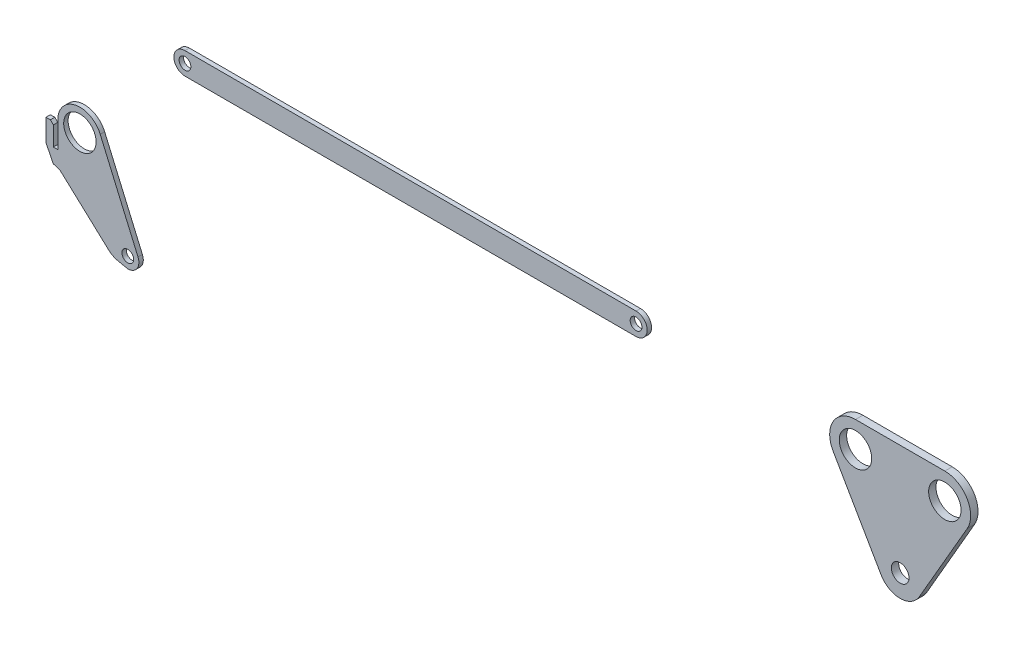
ISO-10303-21;
HEADER;
FILE_DESCRIPTION(('STEP AP214'),'2;1');
FILE_NAME('part.step','',(''),(''),'','','');
FILE_SCHEMA(('AUTOMOTIVE_DESIGN { 1 0 10303 214 1 1 1 1 }'));
ENDSEC;
DATA;
#1=APPLICATION_CONTEXT('core data for automotive mechanical design processes');
#2=APPLICATION_PROTOCOL_DEFINITION('international standard','automotive_design',2000,#1);
#3=PRODUCT_CONTEXT('',#1,'mechanical');
#4=PRODUCT('Part','Part','',(#3));
#5=PRODUCT_RELATED_PRODUCT_CATEGORY('part','',(#4));
#6=PRODUCT_DEFINITION_FORMATION('','',#4);
#7=PRODUCT_DEFINITION_CONTEXT('part definition',#1,'design');
#8=PRODUCT_DEFINITION('design','',#6,#7);
#9=PRODUCT_DEFINITION_SHAPE('','',#8);
#10=(LENGTH_UNIT() NAMED_UNIT(*) SI_UNIT(.MILLI.,.METRE.));
#11=(NAMED_UNIT(*) PLANE_ANGLE_UNIT() SI_UNIT($,.RADIAN.));
#12=(NAMED_UNIT(*) SI_UNIT($,.STERADIAN.) SOLID_ANGLE_UNIT());
#13=UNCERTAINTY_MEASURE_WITH_UNIT(LENGTH_MEASURE(1.E-05),#10,'distance_accuracy_value','');
#14=(GEOMETRIC_REPRESENTATION_CONTEXT(3) GLOBAL_UNCERTAINTY_ASSIGNED_CONTEXT((#13)) GLOBAL_UNIT_ASSIGNED_CONTEXT((#10,
#11,#12)) REPRESENTATION_CONTEXT('',''));
#15=CARTESIAN_POINT('',(0.,0.,0.));
#16=DIRECTION('',(0.,0.,1.));
#17=DIRECTION('',(1.,0.,0.));
#18=AXIS2_PLACEMENT_3D('',#15,#16,#17);
#19=CARTESIAN_POINT('',(-475.912806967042,-67.8616147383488,53.));
#20=DIRECTION('',(0.,0.,1.));
#21=DIRECTION('',(1.,0.,0.));
#22=AXIS2_PLACEMENT_3D('',#19,#20,#21);
#23=PLANE('',#22);
#24=CARTESIAN_POINT('',(-508.412806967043,-11.5699634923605,53.));
#25=DIRECTION('',(0.,0.,1.));
#26=DIRECTION('',(1.,0.,0.));
#27=AXIS2_PLACEMENT_3D('',#24,#25,#26);
#28=CIRCLE('',#27,11.0000000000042);
#29=CARTESIAN_POINT('',(-497.412806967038,-11.5699634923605,53.));
#30=VERTEX_POINT('',#29);
#31=EDGE_CURVE('E187',#30,#30,#28,.T.);
#32=ORIENTED_EDGE('',*,*,#31,.F.);
#33=EDGE_LOOP('',(#32));
#34=FACE_BOUND('',#33,.T.);
#35=DIRECTION('',(-1.,0.,0.));
#36=VECTOR('',#35,1.);
#37=CARTESIAN_POINT('',(-523.412806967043,-29.0150571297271,53.));
#38=LINE('',#37,#36);
#39=CARTESIAN_POINT('',(-523.412806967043,-29.0150571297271,53.));
#40=VERTEX_POINT('',#39);
#41=CARTESIAN_POINT('',(-526.412806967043,-29.0150571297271,53.));
#42=VERTEX_POINT('',#41);
#43=EDGE_CURVE('E212',#40,#42,#38,.T.);
#44=ORIENTED_EDGE('',*,*,#43,.T.);
#45=DIRECTION('',(0.,1.,0.));
#46=VECTOR('',#45,1.);
#47=CARTESIAN_POINT('',(-526.412806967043,-29.0150571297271,53.));
#48=LINE('',#47,#46);
#49=CARTESIAN_POINT('',(-526.412806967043,-16.0150571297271,53.));
#50=VERTEX_POINT('',#49);
#51=EDGE_CURVE('E125',#42,#50,#48,.T.);
#52=ORIENTED_EDGE('',*,*,#51,.T.);
#53=DIRECTION('',(-0.707106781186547,0.707106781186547,0.));
#54=VECTOR('',#53,1.);
#55=CARTESIAN_POINT('',(-526.412806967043,-16.0150571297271,53.));
#56=LINE('',#55,#54);
#57=CARTESIAN_POINT('',(-528.412806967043,-14.0150571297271,53.));
#58=VERTEX_POINT('',#57);
#59=EDGE_CURVE('E248',#50,#58,#56,.T.);
#60=ORIENTED_EDGE('',*,*,#59,.T.);
#61=DIRECTION('',(-1.,0.,0.));
#62=VECTOR('',#61,1.);
#63=CARTESIAN_POINT('',(-528.412806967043,-14.0150571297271,53.));
#64=LINE('',#63,#62);
#65=CARTESIAN_POINT('',(-531.412806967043,-14.0150571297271,53.));
#66=VERTEX_POINT('',#65);
#67=EDGE_CURVE('E267',#58,#66,#64,.T.);
#68=ORIENTED_EDGE('',*,*,#67,.T.);
#69=DIRECTION('',(0.,-1.,0.));
#70=VECTOR('',#69,1.);
#71=CARTESIAN_POINT('',(-531.412806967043,-14.0150571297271,53.));
#72=LINE('',#71,#70);
#73=CARTESIAN_POINT('',(-531.412806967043,-29.0150571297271,53.));
#74=VERTEX_POINT('',#73);
#75=EDGE_CURVE('E264',#66,#74,#72,.T.);
#76=ORIENTED_EDGE('',*,*,#75,.T.);
#77=DIRECTION('',(0.447213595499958,-0.894427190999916,0.));
#78=VECTOR('',#77,1.);
#79=CARTESIAN_POINT('',(-531.412806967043,-29.0150571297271,53.));
#80=LINE('',#79,#78);
#81=CARTESIAN_POINT('',(-526.412806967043,-39.0150571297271,53.));
#82=VERTEX_POINT('',#81);
#83=EDGE_CURVE('E266',#74,#82,#80,.T.);
#84=ORIENTED_EDGE('',*,*,#83,.T.);
#85=DIRECTION('',(1.,0.,0.));
#86=VECTOR('',#85,1.);
#87=CARTESIAN_POINT('',(-526.412806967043,-39.0150571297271,53.));
#88=LINE('',#87,#86);
#89=CARTESIAN_POINT('',(-525.412806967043,-39.0150571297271,53.));
#90=VERTEX_POINT('',#89);
#91=EDGE_CURVE('E269',#82,#90,#88,.T.);
#92=ORIENTED_EDGE('',*,*,#91,.T.);
#93=DIRECTION('',(0.931756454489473,-0.363083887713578,0.));
#94=VECTOR('',#93,1.);
#95=CARTESIAN_POINT('',(-525.412806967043,-39.0150571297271,53.));
#96=LINE('',#95,#94);
#97=CARTESIAN_POINT('',(-521.940126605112,-40.3682801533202,53.));
#98=VERTEX_POINT('',#97);
#99=EDGE_CURVE('E275',#90,#98,#96,.T.);
#100=ORIENTED_EDGE('',*,*,#99,.T.);
#101=DIRECTION('',(0.736340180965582,-0.676611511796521,0.));
#102=VECTOR('',#101,1.);
#103=CARTESIAN_POINT('',(-521.940126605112,-40.3682801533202,53.));
#104=LINE('',#103,#102);
#105=CARTESIAN_POINT('',(-487.691647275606,-71.8386738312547,53.));
#106=VERTEX_POINT('',#105);
#107=EDGE_CURVE('E277',#98,#106,#104,.T.);
#108=ORIENTED_EDGE('',*,*,#107,.T.);
#109=DIRECTION('',(0.889144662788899,-0.45762623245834,0.));
#110=VECTOR('',#109,1.);
#111=CARTESIAN_POINT('',(-487.691647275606,-71.8386738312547,53.));
#112=LINE('',#111,#110);
#113=CARTESIAN_POINT('',(-484.261867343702,-73.6039178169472,53.));
#114=VERTEX_POINT('',#113);
#115=EDGE_CURVE('E279',#106,#114,#112,.T.);
#116=ORIENTED_EDGE('',*,*,#115,.T.);
#117=DIRECTION('',(0.978549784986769,-0.206010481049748,0.));
#118=VECTOR('',#117,1.);
#119=CARTESIAN_POINT('',(-484.261867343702,-73.6039178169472,53.));
#120=LINE('',#119,#118);
#121=CARTESIAN_POINT('',(-475.91280696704,-75.3616147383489,53.));
#122=VERTEX_POINT('',#121);
#123=EDGE_CURVE('E281',#114,#122,#120,.T.);
#124=ORIENTED_EDGE('',*,*,#123,.T.);
#125=CARTESIAN_POINT('',(-475.912806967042,-67.8616147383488,53.));
#126=DIRECTION('',(0.,0.,1.));
#127=DIRECTION('',(1.,0.,0.));
#128=AXIS2_PLACEMENT_3D('',#125,#126,#127);
#129=CIRCLE('',#128,7.50000000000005);
#130=CARTESIAN_POINT('',(-469.028306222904,-64.8861064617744,53.));
#131=VERTEX_POINT('',#130);
#132=EDGE_CURVE('E165',#122,#131,#129,.T.);
#133=ORIENTED_EDGE('',*,*,#132,.T.);
#134=DIRECTION('',(-0.396734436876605,0.917933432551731,0.));
#135=VECTOR('',#134,1.);
#136=CARTESIAN_POINT('',(-494.643805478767,-5.61894693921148,53.));
#137=LINE('',#136,#135);
#138=CARTESIAN_POINT('',(-494.643805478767,-5.61894693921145,53.));
#139=VERTEX_POINT('',#138);
#140=EDGE_CURVE('E159',#131,#139,#137,.T.);
#141=ORIENTED_EDGE('',*,*,#140,.T.);
#142=CARTESIAN_POINT('',(-508.412806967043,-11.5699634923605,53.));
#143=DIRECTION('',(0.,0.,1.));
#144=DIRECTION('',(1.,0.,0.));
#145=AXIS2_PLACEMENT_3D('',#142,#143,#144);
#146=CIRCLE('',#145,15.0000000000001);
#147=CARTESIAN_POINT('',(-523.412806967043,-11.5699634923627,53.));
#148=VERTEX_POINT('',#147);
#149=EDGE_CURVE('E163',#139,#148,#146,.T.);
#150=ORIENTED_EDGE('',*,*,#149,.T.);
#151=DIRECTION('',(0.,-1.,0.));
#152=VECTOR('',#151,1.);
#153=CARTESIAN_POINT('',(-523.412806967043,-11.5699634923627,53.));
#154=LINE('',#153,#152);
#155=EDGE_CURVE('E61',#148,#40,#154,.T.);
#156=ORIENTED_EDGE('',*,*,#155,.T.);
#157=EDGE_LOOP('',(#44,#52,#60,#68,#76,#84,#92,#100,#108,#116,#124,#133,#141,#150,#156));
#158=FACE_BOUND('',#157,.T.);
#159=CARTESIAN_POINT('',(-475.912806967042,-67.8616147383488,53.));
#160=DIRECTION('',(0.,0.,1.));
#161=DIRECTION('',(1.,0.,0.));
#162=AXIS2_PLACEMENT_3D('',#159,#160,#161);
#163=CIRCLE('',#162,4.0000000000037);
#164=CARTESIAN_POINT('',(-471.912806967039,-67.8616147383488,53.));
#165=VERTEX_POINT('',#164);
#166=EDGE_CURVE('E323',#165,#165,#163,.T.);
#167=ORIENTED_EDGE('',*,*,#166,.F.);
#168=EDGE_LOOP('',(#167));
#169=FACE_BOUND('',#168,.T.);
#170=ADVANCED_FACE('F44',(#34,#158,#169),#23,.T.);
#171=CARTESIAN_POINT('',(-475.912806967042,-67.8616147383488,50.));
#172=DIRECTION('',(0.,0.,1.));
#173=DIRECTION('',(1.,0.,0.));
#174=AXIS2_PLACEMENT_3D('',#171,#172,#173);
#175=PLANE('',#174);
#176=DIRECTION('',(-1.,0.,0.));
#177=VECTOR('',#176,1.);
#178=CARTESIAN_POINT('',(-523.412806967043,-29.0150571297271,50.));
#179=LINE('',#178,#177);
#180=CARTESIAN_POINT('',(-523.412806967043,-29.0150571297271,50.));
#181=VERTEX_POINT('',#180);
#182=CARTESIAN_POINT('',(-526.412806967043,-29.0150571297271,50.));
#183=VERTEX_POINT('',#182);
#184=EDGE_CURVE('E183',#181,#183,#179,.T.);
#185=ORIENTED_EDGE('',*,*,#184,.F.);
#186=DIRECTION('',(0.,-1.,0.));
#187=VECTOR('',#186,1.);
#188=CARTESIAN_POINT('',(-523.412806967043,-11.5699634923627,50.));
#189=LINE('',#188,#187);
#190=CARTESIAN_POINT('',(-523.412806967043,-11.5699634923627,50.));
#191=VERTEX_POINT('',#190);
#192=EDGE_CURVE('E117',#191,#181,#189,.T.);
#193=ORIENTED_EDGE('',*,*,#192,.F.);
#194=CARTESIAN_POINT('',(-508.412806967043,-11.5699634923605,50.));
#195=DIRECTION('',(0.,0.,1.));
#196=DIRECTION('',(1.,0.,0.));
#197=AXIS2_PLACEMENT_3D('',#194,#195,#196);
#198=CIRCLE('',#197,15.0000000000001);
#199=CARTESIAN_POINT('',(-494.643805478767,-5.61894693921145,50.));
#200=VERTEX_POINT('',#199);
#201=EDGE_CURVE('E111',#200,#191,#198,.T.);
#202=ORIENTED_EDGE('',*,*,#201,.F.);
#203=DIRECTION('',(-0.396734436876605,0.917933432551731,0.));
#204=VECTOR('',#203,1.);
#205=CARTESIAN_POINT('',(-494.643805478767,-5.61894693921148,50.));
#206=LINE('',#205,#204);
#207=CARTESIAN_POINT('',(-469.028306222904,-64.8861064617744,50.));
#208=VERTEX_POINT('',#207);
#209=EDGE_CURVE('E173',#208,#200,#206,.T.);
#210=ORIENTED_EDGE('',*,*,#209,.F.);
#211=CARTESIAN_POINT('',(-475.912806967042,-67.8616147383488,50.));
#212=DIRECTION('',(0.,0.,1.));
#213=DIRECTION('',(1.,0.,0.));
#214=AXIS2_PLACEMENT_3D('',#211,#212,#213);
#215=CIRCLE('',#214,7.50000000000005);
#216=CARTESIAN_POINT('',(-475.91280696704,-75.3616147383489,50.));
#217=VERTEX_POINT('',#216);
#218=EDGE_CURVE('E207',#217,#208,#215,.T.);
#219=ORIENTED_EDGE('',*,*,#218,.F.);
#220=DIRECTION('',(0.978549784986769,-0.206010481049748,0.));
#221=VECTOR('',#220,1.);
#222=CARTESIAN_POINT('',(-484.261867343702,-73.6039178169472,50.));
#223=LINE('',#222,#221);
#224=CARTESIAN_POINT('',(-484.261867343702,-73.6039178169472,50.));
#225=VERTEX_POINT('',#224);
#226=EDGE_CURVE('E205',#225,#217,#223,.T.);
#227=ORIENTED_EDGE('',*,*,#226,.F.);
#228=DIRECTION('',(0.889144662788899,-0.45762623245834,0.));
#229=VECTOR('',#228,1.);
#230=CARTESIAN_POINT('',(-487.691647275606,-71.8386738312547,50.));
#231=LINE('',#230,#229);
#232=CARTESIAN_POINT('',(-487.691647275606,-71.8386738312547,50.));
#233=VERTEX_POINT('',#232);
#234=EDGE_CURVE('E203',#233,#225,#231,.T.);
#235=ORIENTED_EDGE('',*,*,#234,.F.);
#236=DIRECTION('',(0.736340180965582,-0.676611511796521,0.));
#237=VECTOR('',#236,1.);
#238=CARTESIAN_POINT('',(-521.940126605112,-40.3682801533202,50.));
#239=LINE('',#238,#237);
#240=CARTESIAN_POINT('',(-521.940126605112,-40.3682801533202,50.));
#241=VERTEX_POINT('',#240);
#242=EDGE_CURVE('E201',#241,#233,#239,.T.);
#243=ORIENTED_EDGE('',*,*,#242,.F.);
#244=DIRECTION('',(0.931756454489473,-0.363083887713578,0.));
#245=VECTOR('',#244,1.);
#246=CARTESIAN_POINT('',(-525.412806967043,-39.0150571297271,50.));
#247=LINE('',#246,#245);
#248=CARTESIAN_POINT('',(-525.412806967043,-39.0150571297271,50.));
#249=VERTEX_POINT('',#248);
#250=EDGE_CURVE('E199',#249,#241,#247,.T.);
#251=ORIENTED_EDGE('',*,*,#250,.F.);
#252=DIRECTION('',(1.,0.,0.));
#253=VECTOR('',#252,1.);
#254=CARTESIAN_POINT('',(-526.412806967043,-39.0150571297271,50.));
#255=LINE('',#254,#253);
#256=CARTESIAN_POINT('',(-526.412806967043,-39.0150571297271,50.));
#257=VERTEX_POINT('',#256);
#258=EDGE_CURVE('E197',#257,#249,#255,.T.);
#259=ORIENTED_EDGE('',*,*,#258,.F.);
#260=DIRECTION('',(0.447213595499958,-0.894427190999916,0.));
#261=VECTOR('',#260,1.);
#262=CARTESIAN_POINT('',(-531.412806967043,-29.0150571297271,50.));
#263=LINE('',#262,#261);
#264=CARTESIAN_POINT('',(-531.412806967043,-29.0150571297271,50.));
#265=VERTEX_POINT('',#264);
#266=EDGE_CURVE('E195',#265,#257,#263,.T.);
#267=ORIENTED_EDGE('',*,*,#266,.F.);
#268=DIRECTION('',(0.,-1.,0.));
#269=VECTOR('',#268,1.);
#270=CARTESIAN_POINT('',(-531.412806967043,-14.0150571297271,50.));
#271=LINE('',#270,#269);
#272=CARTESIAN_POINT('',(-531.412806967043,-14.0150571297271,50.));
#273=VERTEX_POINT('',#272);
#274=EDGE_CURVE('E193',#273,#265,#271,.T.);
#275=ORIENTED_EDGE('',*,*,#274,.F.);
#276=DIRECTION('',(-1.,0.,0.));
#277=VECTOR('',#276,1.);
#278=CARTESIAN_POINT('',(-528.412806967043,-14.0150571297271,50.));
#279=LINE('',#278,#277);
#280=CARTESIAN_POINT('',(-528.412806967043,-14.0150571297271,50.));
#281=VERTEX_POINT('',#280);
#282=EDGE_CURVE('E191',#281,#273,#279,.T.);
#283=ORIENTED_EDGE('',*,*,#282,.F.);
#284=DIRECTION('',(-0.707106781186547,0.707106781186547,0.));
#285=VECTOR('',#284,1.);
#286=CARTESIAN_POINT('',(-526.412806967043,-16.0150571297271,50.));
#287=LINE('',#286,#285);
#288=CARTESIAN_POINT('',(-526.412806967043,-16.0150571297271,50.));
#289=VERTEX_POINT('',#288);
#290=EDGE_CURVE('E189',#289,#281,#287,.T.);
#291=ORIENTED_EDGE('',*,*,#290,.F.);
#292=DIRECTION('',(0.,1.,0.));
#293=VECTOR('',#292,1.);
#294=CARTESIAN_POINT('',(-526.412806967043,-29.0150571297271,50.));
#295=LINE('',#294,#293);
#296=EDGE_CURVE('E186',#183,#289,#295,.T.);
#297=ORIENTED_EDGE('',*,*,#296,.F.);
#298=EDGE_LOOP('',(#185,#193,#202,#210,#219,#227,#235,#243,#251,#259,#267,#275,#283,#291,#297));
#299=FACE_BOUND('',#298,.T.);
#300=CARTESIAN_POINT('',(-508.412806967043,-11.5699634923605,50.));
#301=DIRECTION('',(0.,0.,1.));
#302=DIRECTION('',(1.,0.,0.));
#303=AXIS2_PLACEMENT_3D('',#300,#301,#302);
#304=CIRCLE('',#303,11.0000000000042);
#305=CARTESIAN_POINT('',(-497.412806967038,-11.5699634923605,50.));
#306=VERTEX_POINT('',#305);
#307=EDGE_CURVE('E329',#306,#306,#304,.T.);
#308=ORIENTED_EDGE('',*,*,#307,.T.);
#309=EDGE_LOOP('',(#308));
#310=FACE_BOUND('',#309,.T.);
#311=CARTESIAN_POINT('',(-475.912806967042,-67.8616147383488,50.));
#312=DIRECTION('',(0.,0.,1.));
#313=DIRECTION('',(1.,0.,0.));
#314=AXIS2_PLACEMENT_3D('',#311,#312,#313);
#315=CIRCLE('',#314,4.0000000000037);
#316=CARTESIAN_POINT('',(-471.912806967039,-67.8616147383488,50.));
#317=VERTEX_POINT('',#316);
#318=EDGE_CURVE('E326',#317,#317,#315,.T.);
#319=ORIENTED_EDGE('',*,*,#318,.T.);
#320=EDGE_LOOP('',(#319));
#321=FACE_BOUND('',#320,.T.);
#322=ADVANCED_FACE('F252',(#299,#310,#321),#175,.F.);
#323=CARTESIAN_POINT('',(-523.412806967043,-29.0150571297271,53.));
#324=DIRECTION('',(0.,-1.,0.));
#325=DIRECTION('',(0.,0.,-1.));
#326=AXIS2_PLACEMENT_3D('',#323,#324,#325);
#327=PLANE('',#326);
#328=ORIENTED_EDGE('',*,*,#184,.T.);
#329=DIRECTION('',(0.,0.,-1.));
#330=VECTOR('',#329,1.);
#331=CARTESIAN_POINT('',(-526.412806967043,-29.0150571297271,53.));
#332=LINE('',#331,#330);
#333=EDGE_CURVE('E12',#42,#183,#332,.T.);
#334=ORIENTED_EDGE('',*,*,#333,.F.);
#335=ORIENTED_EDGE('',*,*,#43,.F.);
#336=DIRECTION('',(0.,0.,-1.));
#337=VECTOR('',#336,1.);
#338=CARTESIAN_POINT('',(-523.412806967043,-29.0150571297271,53.));
#339=LINE('',#338,#337);
#340=EDGE_CURVE('E179',#40,#181,#339,.T.);
#341=ORIENTED_EDGE('',*,*,#340,.T.);
#342=EDGE_LOOP('',(#328,#334,#335,#341));
#343=FACE_BOUND('',#342,.T.);
#344=ADVANCED_FACE('F46',(#343),#327,.F.);
#345=CARTESIAN_POINT('',(-526.412806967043,-29.0150571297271,53.));
#346=DIRECTION('',(-1.,0.,0.));
#347=DIRECTION('',(0.,0.,1.));
#348=AXIS2_PLACEMENT_3D('',#345,#346,#347);
#349=PLANE('',#348);
#350=ORIENTED_EDGE('',*,*,#296,.T.);
#351=DIRECTION('',(0.,0.,-1.));
#352=VECTOR('',#351,1.);
#353=CARTESIAN_POINT('',(-526.412806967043,-16.0150571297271,53.));
#354=LINE('',#353,#352);
#355=EDGE_CURVE('E53',#50,#289,#354,.T.);
#356=ORIENTED_EDGE('',*,*,#355,.F.);
#357=ORIENTED_EDGE('',*,*,#51,.F.);
#358=ORIENTED_EDGE('',*,*,#333,.T.);
#359=EDGE_LOOP('',(#350,#356,#357,#358));
#360=FACE_BOUND('',#359,.T.);
#361=ADVANCED_FACE('F452',(#360),#349,.F.);
#362=CARTESIAN_POINT('',(-526.412806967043,-16.0150571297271,53.));
#363=DIRECTION('',(-0.707106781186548,-0.707106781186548,0.));
#364=DIRECTION('',(0.707106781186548,-0.707106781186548,0.));
#365=AXIS2_PLACEMENT_3D('',#362,#363,#364);
#366=PLANE('',#365);
#367=ORIENTED_EDGE('',*,*,#290,.T.);
#368=DIRECTION('',(0.,0.,-1.));
#369=VECTOR('',#368,1.);
#370=CARTESIAN_POINT('',(-528.412806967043,-14.0150571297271,53.));
#371=LINE('',#370,#369);
#372=EDGE_CURVE('E240',#58,#281,#371,.T.);
#373=ORIENTED_EDGE('',*,*,#372,.F.);
#374=ORIENTED_EDGE('',*,*,#59,.F.);
#375=ORIENTED_EDGE('',*,*,#355,.T.);
#376=EDGE_LOOP('',(#367,#373,#374,#375));
#377=FACE_BOUND('',#376,.T.);
#378=ADVANCED_FACE('F246',(#377),#366,.F.);
#379=CARTESIAN_POINT('',(-528.412806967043,-14.0150571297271,53.));
#380=DIRECTION('',(0.,-1.,0.));
#381=DIRECTION('',(0.,0.,-1.));
#382=AXIS2_PLACEMENT_3D('',#379,#380,#381);
#383=PLANE('',#382);
#384=ORIENTED_EDGE('',*,*,#282,.T.);
#385=DIRECTION('',(0.,0.,-1.));
#386=VECTOR('',#385,1.);
#387=CARTESIAN_POINT('',(-531.412806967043,-14.0150571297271,53.));
#388=LINE('',#387,#386);
#389=EDGE_CURVE('E237',#66,#273,#388,.T.);
#390=ORIENTED_EDGE('',*,*,#389,.F.);
#391=ORIENTED_EDGE('',*,*,#67,.F.);
#392=ORIENTED_EDGE('',*,*,#372,.T.);
#393=EDGE_LOOP('',(#384,#390,#391,#392));
#394=FACE_BOUND('',#393,.T.);
#395=ADVANCED_FACE('F258',(#394),#383,.F.);
#396=CARTESIAN_POINT('',(-531.412806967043,-14.0150571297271,53.));
#397=DIRECTION('',(1.,0.,0.));
#398=DIRECTION('',(0.,0.,-1.));
#399=AXIS2_PLACEMENT_3D('',#396,#397,#398);
#400=PLANE('',#399);
#401=ORIENTED_EDGE('',*,*,#274,.T.);
#402=DIRECTION('',(0.,0.,-1.));
#403=VECTOR('',#402,1.);
#404=CARTESIAN_POINT('',(-531.412806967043,-29.0150571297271,53.));
#405=LINE('',#404,#403);
#406=EDGE_CURVE('E234',#74,#265,#405,.T.);
#407=ORIENTED_EDGE('',*,*,#406,.F.);
#408=ORIENTED_EDGE('',*,*,#75,.F.);
#409=ORIENTED_EDGE('',*,*,#389,.T.);
#410=EDGE_LOOP('',(#401,#407,#408,#409));
#411=FACE_BOUND('',#410,.T.);
#412=ADVANCED_FACE('F262',(#411),#400,.F.);
#413=CARTESIAN_POINT('',(-531.412806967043,-29.0150571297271,53.));
#414=DIRECTION('',(0.894427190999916,0.447213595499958,0.));
#415=DIRECTION('',(-0.447213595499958,0.894427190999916,0.));
#416=AXIS2_PLACEMENT_3D('',#413,#414,#415);
#417=PLANE('',#416);
#418=ORIENTED_EDGE('',*,*,#266,.T.);
#419=DIRECTION('',(0.,0.,-1.));
#420=VECTOR('',#419,1.);
#421=CARTESIAN_POINT('',(-526.412806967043,-39.0150571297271,53.));
#422=LINE('',#421,#420);
#423=EDGE_CURVE('E231',#82,#257,#422,.T.);
#424=ORIENTED_EDGE('',*,*,#423,.F.);
#425=ORIENTED_EDGE('',*,*,#83,.F.);
#426=ORIENTED_EDGE('',*,*,#406,.T.);
#427=EDGE_LOOP('',(#418,#424,#425,#426));
#428=FACE_BOUND('',#427,.T.);
#429=ADVANCED_FACE('F417',(#428),#417,.F.);
#430=CARTESIAN_POINT('',(-526.412806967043,-39.0150571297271,53.));
#431=DIRECTION('',(0.,1.,0.));
#432=DIRECTION('',(0.,0.,1.));
#433=AXIS2_PLACEMENT_3D('',#430,#431,#432);
#434=PLANE('',#433);
#435=ORIENTED_EDGE('',*,*,#258,.T.);
#436=DIRECTION('',(0.,0.,-1.));
#437=VECTOR('',#436,1.);
#438=CARTESIAN_POINT('',(-525.412806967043,-39.0150571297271,53.));
#439=LINE('',#438,#437);
#440=EDGE_CURVE('E228',#90,#249,#439,.T.);
#441=ORIENTED_EDGE('',*,*,#440,.F.);
#442=ORIENTED_EDGE('',*,*,#91,.F.);
#443=ORIENTED_EDGE('',*,*,#423,.T.);
#444=EDGE_LOOP('',(#435,#441,#442,#443));
#445=FACE_BOUND('',#444,.T.);
#446=ADVANCED_FACE('F407',(#445),#434,.F.);
#447=CARTESIAN_POINT('',(-525.412806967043,-39.0150571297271,53.));
#448=DIRECTION('',(0.363083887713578,0.931756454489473,0.));
#449=DIRECTION('',(-0.931756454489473,0.363083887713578,0.));
#450=AXIS2_PLACEMENT_3D('',#447,#448,#449);
#451=PLANE('',#450);
#452=ORIENTED_EDGE('',*,*,#250,.T.);
#453=DIRECTION('',(0.,0.,-1.));
#454=VECTOR('',#453,1.);
#455=CARTESIAN_POINT('',(-521.940126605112,-40.3682801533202,53.));
#456=LINE('',#455,#454);
#457=EDGE_CURVE('E225',#98,#241,#456,.T.);
#458=ORIENTED_EDGE('',*,*,#457,.F.);
#459=ORIENTED_EDGE('',*,*,#99,.F.);
#460=ORIENTED_EDGE('',*,*,#440,.T.);
#461=EDGE_LOOP('',(#452,#458,#459,#460));
#462=FACE_BOUND('',#461,.T.);
#463=ADVANCED_FACE('F397',(#462),#451,.F.);
#464=CARTESIAN_POINT('',(-521.940126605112,-40.3682801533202,53.));
#465=DIRECTION('',(0.676611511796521,0.736340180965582,0.));
#466=DIRECTION('',(-0.736340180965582,0.676611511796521,0.));
#467=AXIS2_PLACEMENT_3D('',#464,#465,#466);
#468=PLANE('',#467);
#469=ORIENTED_EDGE('',*,*,#242,.T.);
#470=DIRECTION('',(0.,0.,-1.));
#471=VECTOR('',#470,1.);
#472=CARTESIAN_POINT('',(-487.691647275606,-71.8386738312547,53.));
#473=LINE('',#472,#471);
#474=EDGE_CURVE('E222',#106,#233,#473,.T.);
#475=ORIENTED_EDGE('',*,*,#474,.F.);
#476=ORIENTED_EDGE('',*,*,#107,.F.);
#477=ORIENTED_EDGE('',*,*,#457,.T.);
#478=EDGE_LOOP('',(#469,#475,#476,#477));
#479=FACE_BOUND('',#478,.T.);
#480=ADVANCED_FACE('F387',(#479),#468,.F.);
#481=CARTESIAN_POINT('',(-487.691647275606,-71.8386738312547,53.));
#482=DIRECTION('',(0.45762623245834,0.889144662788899,0.));
#483=DIRECTION('',(-0.889144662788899,0.45762623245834,0.));
#484=AXIS2_PLACEMENT_3D('',#481,#482,#483);
#485=PLANE('',#484);
#486=ORIENTED_EDGE('',*,*,#234,.T.);
#487=DIRECTION('',(0.,0.,-1.));
#488=VECTOR('',#487,1.);
#489=CARTESIAN_POINT('',(-484.261867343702,-73.6039178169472,53.));
#490=LINE('',#489,#488);
#491=EDGE_CURVE('E219',#114,#225,#490,.T.);
#492=ORIENTED_EDGE('',*,*,#491,.F.);
#493=ORIENTED_EDGE('',*,*,#115,.F.);
#494=ORIENTED_EDGE('',*,*,#474,.T.);
#495=EDGE_LOOP('',(#486,#492,#493,#494));
#496=FACE_BOUND('',#495,.T.);
#497=ADVANCED_FACE('F378',(#496),#485,.F.);
#498=CARTESIAN_POINT('',(-484.261867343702,-73.6039178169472,53.));
#499=DIRECTION('',(0.206010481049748,0.978549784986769,0.));
#500=DIRECTION('',(-0.978549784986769,0.206010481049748,0.));
#501=AXIS2_PLACEMENT_3D('',#498,#499,#500);
#502=PLANE('',#501);
#503=ORIENTED_EDGE('',*,*,#226,.T.);
#504=DIRECTION('',(0.,0.,-1.));
#505=VECTOR('',#504,1.);
#506=CARTESIAN_POINT('',(-475.91280696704,-75.3616147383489,53.));
#507=LINE('',#506,#505);
#508=EDGE_CURVE('E216',#122,#217,#507,.T.);
#509=ORIENTED_EDGE('',*,*,#508,.F.);
#510=ORIENTED_EDGE('',*,*,#123,.F.);
#511=ORIENTED_EDGE('',*,*,#491,.T.);
#512=EDGE_LOOP('',(#503,#509,#510,#511));
#513=FACE_BOUND('',#512,.T.);
#514=ADVANCED_FACE('F287',(#513),#502,.F.);
#515=CARTESIAN_POINT('',(-475.912806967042,-67.8616147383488,53.));
#516=DIRECTION('',(0.,0.,-1.));
#517=DIRECTION('',(-1.,0.,0.));
#518=AXIS2_PLACEMENT_3D('',#515,#516,#517);
#519=CYLINDRICAL_SURFACE('',#518,7.50000000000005);
#520=ORIENTED_EDGE('',*,*,#218,.T.);
#521=DIRECTION('',(0.,0.,-1.));
#522=VECTOR('',#521,1.);
#523=CARTESIAN_POINT('',(-469.028306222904,-64.8861064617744,53.));
#524=LINE('',#523,#522);
#525=EDGE_CURVE('E174',#131,#208,#524,.T.);
#526=ORIENTED_EDGE('',*,*,#525,.F.);
#527=ORIENTED_EDGE('',*,*,#132,.F.);
#528=ORIENTED_EDGE('',*,*,#508,.T.);
#529=EDGE_LOOP('',(#520,#526,#527,#528));
#530=FACE_BOUND('',#529,.T.);
#531=ADVANCED_FACE('F291',(#530),#519,.T.);
#532=CARTESIAN_POINT('',(-494.643805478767,-5.61894693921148,53.));
#533=DIRECTION('',(-0.917933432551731,-0.396734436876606,0.));
#534=DIRECTION('',(0.396734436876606,-0.917933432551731,0.));
#535=AXIS2_PLACEMENT_3D('',#532,#533,#534);
#536=PLANE('',#535);
#537=ORIENTED_EDGE('',*,*,#209,.T.);
#538=DIRECTION('',(0.,0.,-1.));
#539=VECTOR('',#538,1.);
#540=CARTESIAN_POINT('',(-494.643805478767,-5.61894693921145,53.));
#541=LINE('',#540,#539);
#542=EDGE_CURVE('E170',#139,#200,#541,.T.);
#543=ORIENTED_EDGE('',*,*,#542,.F.);
#544=ORIENTED_EDGE('',*,*,#140,.F.);
#545=ORIENTED_EDGE('',*,*,#525,.T.);
#546=EDGE_LOOP('',(#537,#543,#544,#545));
#547=FACE_BOUND('',#546,.T.);
#548=ADVANCED_FACE('F171',(#547),#536,.F.);
#549=CARTESIAN_POINT('',(-508.412806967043,-11.5699634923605,53.));
#550=DIRECTION('',(0.,0.,-1.));
#551=DIRECTION('',(-1.,0.,0.));
#552=AXIS2_PLACEMENT_3D('',#549,#550,#551);
#553=CYLINDRICAL_SURFACE('',#552,15.0000000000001);
#554=ORIENTED_EDGE('',*,*,#201,.T.);
#555=DIRECTION('',(0.,0.,-1.));
#556=VECTOR('',#555,1.);
#557=CARTESIAN_POINT('',(-523.412806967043,-11.5699634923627,53.));
#558=LINE('',#557,#556);
#559=EDGE_CURVE('E175',#148,#191,#558,.T.);
#560=ORIENTED_EDGE('',*,*,#559,.F.);
#561=ORIENTED_EDGE('',*,*,#149,.F.);
#562=ORIENTED_EDGE('',*,*,#542,.T.);
#563=EDGE_LOOP('',(#554,#560,#561,#562));
#564=FACE_BOUND('',#563,.T.);
#565=ADVANCED_FACE('F177',(#564),#553,.T.);
#566=CARTESIAN_POINT('',(-523.412806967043,-11.5699634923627,53.));
#567=DIRECTION('',(1.,0.,0.));
#568=DIRECTION('',(0.,0.,-1.));
#569=AXIS2_PLACEMENT_3D('',#566,#567,#568);
#570=PLANE('',#569);
#571=ORIENTED_EDGE('',*,*,#192,.T.);
#572=ORIENTED_EDGE('',*,*,#340,.F.);
#573=ORIENTED_EDGE('',*,*,#155,.F.);
#574=ORIENTED_EDGE('',*,*,#559,.T.);
#575=EDGE_LOOP('',(#571,#572,#573,#574));
#576=FACE_BOUND('',#575,.T.);
#577=ADVANCED_FACE('F295',(#576),#570,.F.);
#578=CARTESIAN_POINT('',(-508.412806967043,-11.5699634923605,53.));
#579=DIRECTION('',(0.,0.,-1.));
#580=DIRECTION('',(-1.,0.,0.));
#581=AXIS2_PLACEMENT_3D('',#578,#579,#580);
#582=CYLINDRICAL_SURFACE('',#581,11.0000000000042);
#583=ORIENTED_EDGE('',*,*,#31,.T.);
#584=EDGE_LOOP('',(#583));
#585=FACE_BOUND('',#584,.T.);
#586=ORIENTED_EDGE('',*,*,#307,.F.);
#587=EDGE_LOOP('',(#586));
#588=FACE_BOUND('',#587,.T.);
#589=ADVANCED_FACE('F297',(#585,#588),#582,.F.);
#590=CARTESIAN_POINT('',(-475.912806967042,-67.8616147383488,53.));
#591=DIRECTION('',(0.,0.,-1.));
#592=DIRECTION('',(-1.,0.,0.));
#593=AXIS2_PLACEMENT_3D('',#590,#591,#592);
#594=CYLINDRICAL_SURFACE('',#593,4.0000000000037);
#595=ORIENTED_EDGE('',*,*,#166,.T.);
#596=EDGE_LOOP('',(#595));
#597=FACE_BOUND('',#596,.T.);
#598=ORIENTED_EDGE('',*,*,#318,.F.);
#599=EDGE_LOOP('',(#598));
#600=FACE_BOUND('',#599,.T.);
#601=ADVANCED_FACE('F303',(#597,#600),#594,.F.);
#602=CLOSED_SHELL('',(#170,#322,#344,#361,#378,#395,#412,#429,#446,#463,#480,#497,#514,#531,
#548,#565,#577,#589,#601));
#603=MANIFOLD_SOLID_BREP('B2',#602);
#604=CARTESIAN_POINT('',(-156.140133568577,39.7740900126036,28.));
#605=DIRECTION('',(0.,0.,-1.));
#606=DIRECTION('',(-1.,0.,0.));
#607=AXIS2_PLACEMENT_3D('',#604,#605,#606);
#608=PLANE('',#607);
#609=CARTESIAN_POINT('',(-156.140133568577,39.7740900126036,28.));
#610=DIRECTION('',(0.,0.,1.));
#611=DIRECTION('',(-1.,0.,0.));
#612=AXIS2_PLACEMENT_3D('',#609,#610,#611);
#613=CIRCLE('',#612,7.49999999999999);
#614=CARTESIAN_POINT('',(-156.140133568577,32.2740900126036,28.));
#615=VERTEX_POINT('',#614);
#616=CARTESIAN_POINT('',(-156.140133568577,47.2740900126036,28.));
#617=VERTEX_POINT('',#616);
#618=EDGE_CURVE('E557',#615,#617,#613,.T.);
#619=ORIENTED_EDGE('',*,*,#618,.T.);
#620=DIRECTION('',(-1.,0.,0.));
#621=VECTOR('',#620,1.);
#622=CARTESIAN_POINT('',(-462.140133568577,47.2740900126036,28.));
#623=LINE('',#622,#621);
#624=CARTESIAN_POINT('',(-462.140133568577,47.2740900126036,28.));
#625=VERTEX_POINT('',#624);
#626=EDGE_CURVE('E552',#617,#625,#623,.T.);
#627=ORIENTED_EDGE('',*,*,#626,.T.);
#628=CARTESIAN_POINT('',(-462.140133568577,39.7740900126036,28.));
#629=DIRECTION('',(0.,0.,1.));
#630=DIRECTION('',(-1.,0.,0.));
#631=AXIS2_PLACEMENT_3D('',#628,#629,#630);
#632=CIRCLE('',#631,7.5);
#633=CARTESIAN_POINT('',(-462.140133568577,32.2740900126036,28.));
#634=VERTEX_POINT('',#633);
#635=EDGE_CURVE('E555',#625,#634,#632,.T.);
#636=ORIENTED_EDGE('',*,*,#635,.T.);
#637=DIRECTION('',(1.,0.,0.));
#638=VECTOR('',#637,1.);
#639=CARTESIAN_POINT('',(-462.140133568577,32.2740900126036,28.));
#640=LINE('',#639,#638);
#641=EDGE_CURVE('E522',#634,#615,#640,.T.);
#642=ORIENTED_EDGE('',*,*,#641,.T.);
#643=EDGE_LOOP('',(#619,#627,#636,#642));
#644=FACE_BOUND('',#643,.T.);
#645=CARTESIAN_POINT('',(-156.140133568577,39.7740900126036,28.));
#646=DIRECTION('',(0.,0.,1.));
#647=DIRECTION('',(1.,0.,0.));
#648=AXIS2_PLACEMENT_3D('',#645,#646,#647);
#649=CIRCLE('',#648,3.99999999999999);
#650=CARTESIAN_POINT('',(-152.140133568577,39.7740900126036,28.));
#651=VERTEX_POINT('',#650);
#652=EDGE_CURVE('E572',#651,#651,#649,.T.);
#653=ORIENTED_EDGE('',*,*,#652,.F.);
#654=EDGE_LOOP('',(#653));
#655=FACE_BOUND('',#654,.T.);
#656=CARTESIAN_POINT('',(-462.140133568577,39.7740900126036,28.));
#657=DIRECTION('',(0.,0.,1.));
#658=DIRECTION('',(1.,0.,0.));
#659=AXIS2_PLACEMENT_3D('',#656,#657,#658);
#660=CIRCLE('',#659,3.99999999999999);
#661=CARTESIAN_POINT('',(-458.140133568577,39.7740900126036,28.));
#662=VERTEX_POINT('',#661);
#663=EDGE_CURVE('E587',#662,#662,#660,.T.);
#664=ORIENTED_EDGE('',*,*,#663,.F.);
#665=EDGE_LOOP('',(#664));
#666=FACE_BOUND('',#665,.T.);
#667=ADVANCED_FACE('F505',(#644,#655,#666),#608,.F.);
#668=CARTESIAN_POINT('',(-156.140133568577,39.7740900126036,25.));
#669=DIRECTION('',(0.,0.,-1.));
#670=DIRECTION('',(-1.,0.,0.));
#671=AXIS2_PLACEMENT_3D('',#668,#669,#670);
#672=PLANE('',#671);
#673=CARTESIAN_POINT('',(-156.140133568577,39.7740900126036,25.));
#674=DIRECTION('',(0.,0.,1.));
#675=DIRECTION('',(1.,0.,0.));
#676=AXIS2_PLACEMENT_3D('',#673,#674,#675);
#677=CIRCLE('',#676,3.99999999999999);
#678=CARTESIAN_POINT('',(-152.140133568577,39.7740900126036,25.));
#679=VERTEX_POINT('',#678);
#680=EDGE_CURVE('E584',#679,#679,#677,.T.);
#681=ORIENTED_EDGE('',*,*,#680,.T.);
#682=EDGE_LOOP('',(#681));
#683=FACE_BOUND('',#682,.T.);
#684=CARTESIAN_POINT('',(-156.140133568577,39.7740900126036,25.));
#685=DIRECTION('',(0.,0.,1.));
#686=DIRECTION('',(-1.,0.,0.));
#687=AXIS2_PLACEMENT_3D('',#684,#685,#686);
#688=CIRCLE('',#687,7.49999999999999);
#689=CARTESIAN_POINT('',(-156.140133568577,32.2740900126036,25.));
#690=VERTEX_POINT('',#689);
#691=CARTESIAN_POINT('',(-156.140133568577,47.2740900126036,25.));
#692=VERTEX_POINT('',#691);
#693=EDGE_CURVE('E569',#690,#692,#688,.T.);
#694=ORIENTED_EDGE('',*,*,#693,.F.);
#695=DIRECTION('',(1.,0.,0.));
#696=VECTOR('',#695,1.);
#697=CARTESIAN_POINT('',(-462.140133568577,32.2740900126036,25.));
#698=LINE('',#697,#696);
#699=CARTESIAN_POINT('',(-462.140133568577,32.2740900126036,25.));
#700=VERTEX_POINT('',#699);
#701=EDGE_CURVE('E545',#700,#690,#698,.T.);
#702=ORIENTED_EDGE('',*,*,#701,.F.);
#703=CARTESIAN_POINT('',(-462.140133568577,39.7740900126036,25.));
#704=DIRECTION('',(0.,0.,1.));
#705=DIRECTION('',(-1.,0.,0.));
#706=AXIS2_PLACEMENT_3D('',#703,#704,#705);
#707=CIRCLE('',#706,7.5);
#708=CARTESIAN_POINT('',(-462.140133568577,47.2740900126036,25.));
#709=VERTEX_POINT('',#708);
#710=EDGE_CURVE('E539',#709,#700,#707,.T.);
#711=ORIENTED_EDGE('',*,*,#710,.F.);
#712=DIRECTION('',(-1.,0.,0.));
#713=VECTOR('',#712,1.);
#714=CARTESIAN_POINT('',(-462.140133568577,47.2740900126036,25.));
#715=LINE('',#714,#713);
#716=EDGE_CURVE('E561',#692,#709,#715,.T.);
#717=ORIENTED_EDGE('',*,*,#716,.F.);
#718=EDGE_LOOP('',(#694,#702,#711,#717));
#719=FACE_BOUND('',#718,.T.);
#720=CARTESIAN_POINT('',(-462.140133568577,39.7740900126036,25.));
#721=DIRECTION('',(0.,0.,1.));
#722=DIRECTION('',(1.,0.,0.));
#723=AXIS2_PLACEMENT_3D('',#720,#721,#722);
#724=CIRCLE('',#723,3.99999999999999);
#725=CARTESIAN_POINT('',(-458.140133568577,39.7740900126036,25.));
#726=VERTEX_POINT('',#725);
#727=EDGE_CURVE('E590',#726,#726,#724,.T.);
#728=ORIENTED_EDGE('',*,*,#727,.T.);
#729=EDGE_LOOP('',(#728));
#730=FACE_BOUND('',#729,.T.);
#731=ADVANCED_FACE('F580',(#683,#719,#730),#672,.T.);
#732=CARTESIAN_POINT('',(-156.140133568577,39.7740900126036,28.));
#733=DIRECTION('',(0.,0.,-1.));
#734=DIRECTION('',(-1.,0.,0.));
#735=AXIS2_PLACEMENT_3D('',#732,#733,#734);
#736=CYLINDRICAL_SURFACE('',#735,7.49999999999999);
#737=ORIENTED_EDGE('',*,*,#693,.T.);
#738=DIRECTION('',(0.,0.,-1.));
#739=VECTOR('',#738,1.);
#740=CARTESIAN_POINT('',(-156.140133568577,47.2740900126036,28.));
#741=LINE('',#740,#739);
#742=EDGE_CURVE('E42',#617,#692,#741,.T.);
#743=ORIENTED_EDGE('',*,*,#742,.F.);
#744=ORIENTED_EDGE('',*,*,#618,.F.);
#745=DIRECTION('',(0.,0.,-1.));
#746=VECTOR('',#745,1.);
#747=CARTESIAN_POINT('',(-156.140133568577,32.2740900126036,28.));
#748=LINE('',#747,#746);
#749=EDGE_CURVE('E565',#615,#690,#748,.T.);
#750=ORIENTED_EDGE('',*,*,#749,.T.);
#751=EDGE_LOOP('',(#737,#743,#744,#750));
#752=FACE_BOUND('',#751,.T.);
#753=ADVANCED_FACE('F507',(#752),#736,.T.);
#754=CARTESIAN_POINT('',(-462.140133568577,47.2740900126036,28.));
#755=DIRECTION('',(0.,-1.,0.));
#756=DIRECTION('',(1.,0.,0.));
#757=AXIS2_PLACEMENT_3D('',#754,#755,#756);
#758=PLANE('',#757);
#759=ORIENTED_EDGE('',*,*,#716,.T.);
#760=DIRECTION('',(0.,0.,-1.));
#761=VECTOR('',#760,1.);
#762=CARTESIAN_POINT('',(-462.140133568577,47.2740900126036,28.));
#763=LINE('',#762,#761);
#764=EDGE_CURVE('E514',#625,#709,#763,.T.);
#765=ORIENTED_EDGE('',*,*,#764,.F.);
#766=ORIENTED_EDGE('',*,*,#626,.F.);
#767=ORIENTED_EDGE('',*,*,#742,.T.);
#768=EDGE_LOOP('',(#759,#765,#766,#767));
#769=FACE_BOUND('',#768,.T.);
#770=ADVANCED_FACE('F560',(#769),#758,.F.);
#771=CARTESIAN_POINT('',(-462.140133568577,39.7740900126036,28.));
#772=DIRECTION('',(0.,0.,-1.));
#773=DIRECTION('',(-1.,0.,0.));
#774=AXIS2_PLACEMENT_3D('',#771,#772,#773);
#775=CYLINDRICAL_SURFACE('',#774,7.5);
#776=ORIENTED_EDGE('',*,*,#710,.T.);
#777=DIRECTION('',(0.,0.,-1.));
#778=VECTOR('',#777,1.);
#779=CARTESIAN_POINT('',(-462.140133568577,32.2740900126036,28.));
#780=LINE('',#779,#778);
#781=EDGE_CURVE('E562',#634,#700,#780,.T.);
#782=ORIENTED_EDGE('',*,*,#781,.F.);
#783=ORIENTED_EDGE('',*,*,#635,.F.);
#784=ORIENTED_EDGE('',*,*,#764,.T.);
#785=EDGE_LOOP('',(#776,#782,#783,#784));
#786=FACE_BOUND('',#785,.T.);
#787=ADVANCED_FACE('F563',(#786),#775,.T.);
#788=CARTESIAN_POINT('',(-462.140133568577,32.2740900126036,28.));
#789=DIRECTION('',(0.,1.,0.));
#790=DIRECTION('',(0.,0.,1.));
#791=AXIS2_PLACEMENT_3D('',#788,#789,#790);
#792=PLANE('',#791);
#793=ORIENTED_EDGE('',*,*,#701,.T.);
#794=ORIENTED_EDGE('',*,*,#749,.F.);
#795=ORIENTED_EDGE('',*,*,#641,.F.);
#796=ORIENTED_EDGE('',*,*,#781,.T.);
#797=EDGE_LOOP('',(#793,#794,#795,#796));
#798=FACE_BOUND('',#797,.T.);
#799=ADVANCED_FACE('F577',(#798),#792,.F.);
#800=CARTESIAN_POINT('',(-156.140133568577,39.7740900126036,28.));
#801=DIRECTION('',(0.,0.,-1.));
#802=DIRECTION('',(-1.,0.,0.));
#803=AXIS2_PLACEMENT_3D('',#800,#801,#802);
#804=CYLINDRICAL_SURFACE('',#803,3.99999999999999);
#805=ORIENTED_EDGE('',*,*,#652,.T.);
#806=EDGE_LOOP('',(#805));
#807=FACE_BOUND('',#806,.T.);
#808=ORIENTED_EDGE('',*,*,#680,.F.);
#809=EDGE_LOOP('',(#808));
#810=FACE_BOUND('',#809,.T.);
#811=ADVANCED_FACE('F607',(#807,#810),#804,.F.);
#812=CARTESIAN_POINT('',(-462.140133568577,39.7740900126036,28.));
#813=DIRECTION('',(0.,0.,-1.));
#814=DIRECTION('',(-1.,0.,0.));
#815=AXIS2_PLACEMENT_3D('',#812,#813,#814);
#816=CYLINDRICAL_SURFACE('',#815,3.99999999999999);
#817=ORIENTED_EDGE('',*,*,#663,.T.);
#818=EDGE_LOOP('',(#817));
#819=FACE_BOUND('',#818,.T.);
#820=ORIENTED_EDGE('',*,*,#727,.F.);
#821=EDGE_LOOP('',(#820));
#822=FACE_BOUND('',#821,.T.);
#823=ADVANCED_FACE('F596',(#819,#822),#816,.F.);
#824=CLOSED_SHELL('',(#667,#731,#753,#770,#787,#799,#811,#823));
#825=MANIFOLD_SOLID_BREP('B6',#824);
#826=CARTESIAN_POINT('',(-30.3108891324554,17.5,5.));
#827=DIRECTION('',(0.,0.,1.));
#828=DIRECTION('',(1.,0.,0.));
#829=AXIS2_PLACEMENT_3D('',#826,#827,#828);
#830=PLANE('',#829);
#831=CARTESIAN_POINT('',(30.3108891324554,17.5,5.));
#832=DIRECTION('',(0.,0.,1.));
#833=DIRECTION('',(1.,0.,0.));
#834=AXIS2_PLACEMENT_3D('',#831,#832,#833);
#835=CIRCLE('',#834,11.);
#836=CARTESIAN_POINT('',(41.3108891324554,17.5,5.));
#837=VERTEX_POINT('',#836);
#838=EDGE_CURVE('E822',#837,#837,#835,.T.);
#839=ORIENTED_EDGE('',*,*,#838,.F.);
#840=EDGE_LOOP('',(#839));
#841=FACE_BOUND('',#840,.T.);
#842=CARTESIAN_POINT('',(-30.3108891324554,17.5,5.));
#843=DIRECTION('',(0.,0.,1.));
#844=DIRECTION('',(1.,0.,0.));
#845=AXIS2_PLACEMENT_3D('',#842,#843,#844);
#846=CIRCLE('',#845,17.5);
#847=CARTESIAN_POINT('',(-30.3108891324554,35.,5.));
#848=VERTEX_POINT('',#847);
#849=CARTESIAN_POINT('',(-45.466333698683,8.75,5.));
#850=VERTEX_POINT('',#849);
#851=EDGE_CURVE('E767',#848,#850,#846,.T.);
#852=ORIENTED_EDGE('',*,*,#851,.T.);
#853=DIRECTION('',(0.5,-0.866025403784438,0.));
#854=VECTOR('',#853,1.);
#855=CARTESIAN_POINT('',(-45.466333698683,8.75,5.));
#856=LINE('',#855,#854);
#857=CARTESIAN_POINT('',(-12.9903810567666,-47.5,5.));
#858=VERTEX_POINT('',#857);
#859=EDGE_CURVE('E725',#850,#858,#856,.T.);
#860=ORIENTED_EDGE('',*,*,#859,.T.);
#861=CARTESIAN_POINT('',(0.,-40.,5.));
#862=DIRECTION('',(0.,0.,1.));
#863=DIRECTION('',(1.,0.,0.));
#864=AXIS2_PLACEMENT_3D('',#861,#862,#863);
#865=CIRCLE('',#864,15.);
#866=CARTESIAN_POINT('',(12.9903810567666,-47.5,5.));
#867=VERTEX_POINT('',#866);
#868=EDGE_CURVE('E738',#858,#867,#865,.T.);
#869=ORIENTED_EDGE('',*,*,#868,.T.);
#870=DIRECTION('',(0.5,0.866025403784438,0.));
#871=VECTOR('',#870,1.);
#872=CARTESIAN_POINT('',(12.9903810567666,-47.5,5.));
#873=LINE('',#872,#871);
#874=CARTESIAN_POINT('',(45.466333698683,8.75000000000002,5.));
#875=VERTEX_POINT('',#874);
#876=EDGE_CURVE('E732',#867,#875,#873,.T.);
#877=ORIENTED_EDGE('',*,*,#876,.T.);
#878=CARTESIAN_POINT('',(30.3108891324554,17.5,5.));
#879=DIRECTION('',(0.,0.,1.));
#880=DIRECTION('',(1.,0.,0.));
#881=AXIS2_PLACEMENT_3D('',#878,#879,#880);
#882=CIRCLE('',#881,17.5);
#883=CARTESIAN_POINT('',(30.3108891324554,35.,5.));
#884=VERTEX_POINT('',#883);
#885=EDGE_CURVE('E736',#875,#884,#882,.T.);
#886=ORIENTED_EDGE('',*,*,#885,.T.);
#887=DIRECTION('',(-1.,0.,0.));
#888=VECTOR('',#887,1.);
#889=CARTESIAN_POINT('',(30.3108891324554,35.,5.));
#890=LINE('',#889,#888);
#891=EDGE_CURVE('E688',#884,#848,#890,.T.);
#892=ORIENTED_EDGE('',*,*,#891,.T.);
#893=EDGE_LOOP('',(#852,#860,#869,#877,#886,#892));
#894=FACE_BOUND('',#893,.T.);
#895=CARTESIAN_POINT('',(-30.3108891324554,17.5,5.));
#896=DIRECTION('',(0.,0.,1.));
#897=DIRECTION('',(1.,0.,0.));
#898=AXIS2_PLACEMENT_3D('',#895,#896,#897);
#899=CIRCLE('',#898,11.);
#900=CARTESIAN_POINT('',(-19.3108891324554,17.5,5.));
#901=VERTEX_POINT('',#900);
#902=EDGE_CURVE('E760',#901,#901,#899,.T.);
#903=ORIENTED_EDGE('',*,*,#902,.F.);
#904=EDGE_LOOP('',(#903));
#905=FACE_BOUND('',#904,.T.);
#906=CARTESIAN_POINT('',(0.,-40.,5.));
#907=DIRECTION('',(0.,0.,1.));
#908=DIRECTION('',(1.,0.,0.));
#909=AXIS2_PLACEMENT_3D('',#906,#907,#908);
#910=CIRCLE('',#909,6.00000000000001);
#911=CARTESIAN_POINT('',(6.00000000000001,-40.,5.));
#912=VERTEX_POINT('',#911);
#913=EDGE_CURVE('E813',#912,#912,#910,.T.);
#914=ORIENTED_EDGE('',*,*,#913,.F.);
#915=EDGE_LOOP('',(#914));
#916=FACE_BOUND('',#915,.T.);
#917=ADVANCED_FACE('F671',(#841,#894,#905,#916),#830,.T.);
#918=CARTESIAN_POINT('',(-30.3108891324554,17.5,0.));
#919=DIRECTION('',(0.,0.,1.));
#920=DIRECTION('',(1.,0.,0.));
#921=AXIS2_PLACEMENT_3D('',#918,#919,#920);
#922=PLANE('',#921);
#923=CARTESIAN_POINT('',(-30.3108891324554,17.5,0.));
#924=DIRECTION('',(0.,0.,1.));
#925=DIRECTION('',(1.,0.,0.));
#926=AXIS2_PLACEMENT_3D('',#923,#924,#925);
#927=CIRCLE('',#926,17.5);
#928=CARTESIAN_POINT('',(-30.3108891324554,35.,0.));
#929=VERTEX_POINT('',#928);
#930=CARTESIAN_POINT('',(-45.466333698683,8.75,0.));
#931=VERTEX_POINT('',#930);
#932=EDGE_CURVE('E756',#929,#931,#927,.T.);
#933=ORIENTED_EDGE('',*,*,#932,.F.);
#934=DIRECTION('',(-1.,0.,0.));
#935=VECTOR('',#934,1.);
#936=CARTESIAN_POINT('',(30.3108891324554,35.,0.));
#937=LINE('',#936,#935);
#938=CARTESIAN_POINT('',(30.3108891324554,35.,0.));
#939=VERTEX_POINT('',#938);
#940=EDGE_CURVE('E717',#939,#929,#937,.T.);
#941=ORIENTED_EDGE('',*,*,#940,.F.);
#942=CARTESIAN_POINT('',(30.3108891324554,17.5,0.));
#943=DIRECTION('',(0.,0.,1.));
#944=DIRECTION('',(1.,0.,0.));
#945=AXIS2_PLACEMENT_3D('',#942,#943,#944);
#946=CIRCLE('',#945,17.5);
#947=CARTESIAN_POINT('',(45.466333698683,8.75000000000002,0.));
#948=VERTEX_POINT('',#947);
#949=EDGE_CURVE('E711',#948,#939,#946,.T.);
#950=ORIENTED_EDGE('',*,*,#949,.F.);
#951=DIRECTION('',(0.5,0.866025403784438,0.));
#952=VECTOR('',#951,1.);
#953=CARTESIAN_POINT('',(12.9903810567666,-47.5,0.));
#954=LINE('',#953,#952);
#955=CARTESIAN_POINT('',(12.9903810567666,-47.5,0.));
#956=VERTEX_POINT('',#955);
#957=EDGE_CURVE('E746',#956,#948,#954,.T.);
#958=ORIENTED_EDGE('',*,*,#957,.F.);
#959=CARTESIAN_POINT('',(0.,-40.,0.));
#960=DIRECTION('',(0.,0.,1.));
#961=DIRECTION('',(1.,0.,0.));
#962=AXIS2_PLACEMENT_3D('',#959,#960,#961);
#963=CIRCLE('',#962,15.);
#964=CARTESIAN_POINT('',(-12.9903810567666,-47.5,0.));
#965=VERTEX_POINT('',#964);
#966=EDGE_CURVE('E762',#965,#956,#963,.T.);
#967=ORIENTED_EDGE('',*,*,#966,.F.);
#968=DIRECTION('',(0.5,-0.866025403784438,0.));
#969=VECTOR('',#968,1.);
#970=CARTESIAN_POINT('',(-45.466333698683,8.75,0.));
#971=LINE('',#970,#969);
#972=EDGE_CURVE('E759',#931,#965,#971,.T.);
#973=ORIENTED_EDGE('',*,*,#972,.F.);
#974=EDGE_LOOP('',(#933,#941,#950,#958,#967,#973));
#975=FACE_BOUND('',#974,.T.);
#976=CARTESIAN_POINT('',(-30.3108891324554,17.5,0.));
#977=DIRECTION('',(0.,0.,1.));
#978=DIRECTION('',(1.,0.,0.));
#979=AXIS2_PLACEMENT_3D('',#976,#977,#978);
#980=CIRCLE('',#979,11.);
#981=CARTESIAN_POINT('',(-19.3108891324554,17.5,0.));
#982=VERTEX_POINT('',#981);
#983=EDGE_CURVE('E825',#982,#982,#980,.T.);
#984=ORIENTED_EDGE('',*,*,#983,.T.);
#985=EDGE_LOOP('',(#984));
#986=FACE_BOUND('',#985,.T.);
#987=CARTESIAN_POINT('',(30.3108891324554,17.5,0.));
#988=DIRECTION('',(0.,0.,1.));
#989=DIRECTION('',(1.,0.,0.));
#990=AXIS2_PLACEMENT_3D('',#987,#988,#989);
#991=CIRCLE('',#990,11.);
#992=CARTESIAN_POINT('',(41.3108891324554,17.5,0.));
#993=VERTEX_POINT('',#992);
#994=EDGE_CURVE('E819',#993,#993,#991,.T.);
#995=ORIENTED_EDGE('',*,*,#994,.T.);
#996=EDGE_LOOP('',(#995));
#997=FACE_BOUND('',#996,.T.);
#998=CARTESIAN_POINT('',(0.,-40.,0.));
#999=DIRECTION('',(0.,0.,1.));
#1000=DIRECTION('',(1.,0.,0.));
#1001=AXIS2_PLACEMENT_3D('',#998,#999,#1000);
#1002=CIRCLE('',#1001,6.00000000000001);
#1003=CARTESIAN_POINT('',(6.00000000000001,-40.,0.));
#1004=VERTEX_POINT('',#1003);
#1005=EDGE_CURVE('E816',#1004,#1004,#1002,.T.);
#1006=ORIENTED_EDGE('',*,*,#1005,.T.);
#1007=EDGE_LOOP('',(#1006));
#1008=FACE_BOUND('',#1007,.T.);
#1009=ADVANCED_FACE('F776',(#975,#986,#997,#1008),#922,.F.);
#1010=CARTESIAN_POINT('',(-30.3108891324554,17.5,5.));
#1011=DIRECTION('',(0.,0.,-1.));
#1012=DIRECTION('',(-1.,0.,0.));
#1013=AXIS2_PLACEMENT_3D('',#1010,#1011,#1012);
#1014=CYLINDRICAL_SURFACE('',#1013,17.5);
#1015=ORIENTED_EDGE('',*,*,#932,.T.);
#1016=DIRECTION('',(0.,0.,-1.));
#1017=VECTOR('',#1016,1.);
#1018=CARTESIAN_POINT('',(-45.466333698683,8.75,5.));
#1019=LINE('',#1018,#1017);
#1020=EDGE_CURVE('E503',#850,#931,#1019,.T.);
#1021=ORIENTED_EDGE('',*,*,#1020,.F.);
#1022=ORIENTED_EDGE('',*,*,#851,.F.);
#1023=DIRECTION('',(0.,0.,-1.));
#1024=VECTOR('',#1023,1.);
#1025=CARTESIAN_POINT('',(-30.3108891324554,35.,5.));
#1026=LINE('',#1025,#1024);
#1027=EDGE_CURVE('E752',#848,#929,#1026,.T.);
#1028=ORIENTED_EDGE('',*,*,#1027,.T.);
#1029=EDGE_LOOP('',(#1015,#1021,#1022,#1028));
#1030=FACE_BOUND('',#1029,.T.);
#1031=ADVANCED_FACE('F673',(#1030),#1014,.T.);
#1032=CARTESIAN_POINT('',(-45.466333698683,8.75,5.));
#1033=DIRECTION('',(0.866025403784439,0.5,0.));
#1034=DIRECTION('',(-0.5,0.866025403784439,0.));
#1035=AXIS2_PLACEMENT_3D('',#1032,#1033,#1034);
#1036=PLANE('',#1035);
#1037=ORIENTED_EDGE('',*,*,#972,.T.);
#1038=DIRECTION('',(0.,0.,-1.));
#1039=VECTOR('',#1038,1.);
#1040=CARTESIAN_POINT('',(-12.9903810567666,-47.5,5.));
#1041=LINE('',#1040,#1039);
#1042=EDGE_CURVE('E680',#858,#965,#1041,.T.);
#1043=ORIENTED_EDGE('',*,*,#1042,.F.);
#1044=ORIENTED_EDGE('',*,*,#859,.F.);
#1045=ORIENTED_EDGE('',*,*,#1020,.T.);
#1046=EDGE_LOOP('',(#1037,#1043,#1044,#1045));
#1047=FACE_BOUND('',#1046,.T.);
#1048=ADVANCED_FACE('F875',(#1047),#1036,.F.);
#1049=CARTESIAN_POINT('',(0.,-40.,5.));
#1050=DIRECTION('',(0.,0.,-1.));
#1051=DIRECTION('',(-1.,0.,0.));
#1052=AXIS2_PLACEMENT_3D('',#1049,#1050,#1051);
#1053=CYLINDRICAL_SURFACE('',#1052,15.);
#1054=ORIENTED_EDGE('',*,*,#966,.T.);
#1055=DIRECTION('',(0.,0.,-1.));
#1056=VECTOR('',#1055,1.);
#1057=CARTESIAN_POINT('',(12.9903810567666,-47.5,5.));
#1058=LINE('',#1057,#1056);
#1059=EDGE_CURVE('E747',#867,#956,#1058,.T.);
#1060=ORIENTED_EDGE('',*,*,#1059,.F.);
#1061=ORIENTED_EDGE('',*,*,#868,.F.);
#1062=ORIENTED_EDGE('',*,*,#1042,.T.);
#1063=EDGE_LOOP('',(#1054,#1060,#1061,#1062));
#1064=FACE_BOUND('',#1063,.T.);
#1065=ADVANCED_FACE('F773',(#1064),#1053,.T.);
#1066=CARTESIAN_POINT('',(12.9903810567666,-47.5,5.));
#1067=DIRECTION('',(-0.866025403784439,0.5,0.));
#1068=DIRECTION('',(-0.5,-0.866025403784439,0.));
#1069=AXIS2_PLACEMENT_3D('',#1066,#1067,#1068);
#1070=PLANE('',#1069);
#1071=ORIENTED_EDGE('',*,*,#957,.T.);
#1072=DIRECTION('',(0.,0.,-1.));
#1073=VECTOR('',#1072,1.);
#1074=CARTESIAN_POINT('',(45.466333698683,8.75000000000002,5.));
#1075=LINE('',#1074,#1073);
#1076=EDGE_CURVE('E743',#875,#948,#1075,.T.);
#1077=ORIENTED_EDGE('',*,*,#1076,.F.);
#1078=ORIENTED_EDGE('',*,*,#876,.F.);
#1079=ORIENTED_EDGE('',*,*,#1059,.T.);
#1080=EDGE_LOOP('',(#1071,#1077,#1078,#1079));
#1081=FACE_BOUND('',#1080,.T.);
#1082=ADVANCED_FACE('F744',(#1081),#1070,.F.);
#1083=CARTESIAN_POINT('',(30.3108891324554,17.5,5.));
#1084=DIRECTION('',(0.,0.,-1.));
#1085=DIRECTION('',(-1.,0.,0.));
#1086=AXIS2_PLACEMENT_3D('',#1083,#1084,#1085);
#1087=CYLINDRICAL_SURFACE('',#1086,17.5);
#1088=ORIENTED_EDGE('',*,*,#949,.T.);
#1089=DIRECTION('',(0.,0.,-1.));
#1090=VECTOR('',#1089,1.);
#1091=CARTESIAN_POINT('',(30.3108891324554,35.,5.));
#1092=LINE('',#1091,#1090);
#1093=EDGE_CURVE('E748',#884,#939,#1092,.T.);
#1094=ORIENTED_EDGE('',*,*,#1093,.F.);
#1095=ORIENTED_EDGE('',*,*,#885,.F.);
#1096=ORIENTED_EDGE('',*,*,#1076,.T.);
#1097=EDGE_LOOP('',(#1088,#1094,#1095,#1096));
#1098=FACE_BOUND('',#1097,.T.);
#1099=ADVANCED_FACE('F750',(#1098),#1087,.T.);
#1100=CARTESIAN_POINT('',(30.3108891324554,35.,5.));
#1101=DIRECTION('',(0.,-1.,0.));
#1102=DIRECTION('',(1.,0.,0.));
#1103=AXIS2_PLACEMENT_3D('',#1100,#1101,#1102);
#1104=PLANE('',#1103);
#1105=ORIENTED_EDGE('',*,*,#940,.T.);
#1106=ORIENTED_EDGE('',*,*,#1027,.F.);
#1107=ORIENTED_EDGE('',*,*,#891,.F.);
#1108=ORIENTED_EDGE('',*,*,#1093,.T.);
#1109=EDGE_LOOP('',(#1105,#1106,#1107,#1108));
#1110=FACE_BOUND('',#1109,.T.);
#1111=ADVANCED_FACE('F781',(#1110),#1104,.F.);
#1112=CARTESIAN_POINT('',(-30.3108891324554,17.5,5.));
#1113=DIRECTION('',(0.,0.,-1.));
#1114=DIRECTION('',(-1.,0.,0.));
#1115=AXIS2_PLACEMENT_3D('',#1112,#1113,#1114);
#1116=CYLINDRICAL_SURFACE('',#1115,11.);
#1117=ORIENTED_EDGE('',*,*,#902,.T.);
#1118=EDGE_LOOP('',(#1117));
#1119=FACE_BOUND('',#1118,.T.);
#1120=ORIENTED_EDGE('',*,*,#983,.F.);
#1121=EDGE_LOOP('',(#1120));
#1122=FACE_BOUND('',#1121,.T.);
#1123=ADVANCED_FACE('F783',(#1119,#1122),#1116,.F.);
#1124=CARTESIAN_POINT('',(30.3108891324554,17.5,5.));
#1125=DIRECTION('',(0.,0.,-1.));
#1126=DIRECTION('',(-1.,0.,0.));
#1127=AXIS2_PLACEMENT_3D('',#1124,#1125,#1126);
#1128=CYLINDRICAL_SURFACE('',#1127,11.);
#1129=ORIENTED_EDGE('',*,*,#838,.T.);
#1130=EDGE_LOOP('',(#1129));
#1131=FACE_BOUND('',#1130,.T.);
#1132=ORIENTED_EDGE('',*,*,#994,.F.);
#1133=EDGE_LOOP('',(#1132));
#1134=FACE_BOUND('',#1133,.T.);
#1135=ADVANCED_FACE('F789',(#1131,#1134),#1128,.F.);
#1136=CARTESIAN_POINT('',(0.,-40.,5.));
#1137=DIRECTION('',(0.,0.,-1.));
#1138=DIRECTION('',(-1.,0.,0.));
#1139=AXIS2_PLACEMENT_3D('',#1136,#1137,#1138);
#1140=CYLINDRICAL_SURFACE('',#1139,6.00000000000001);
#1141=ORIENTED_EDGE('',*,*,#913,.T.);
#1142=EDGE_LOOP('',(#1141));
#1143=FACE_BOUND('',#1142,.T.);
#1144=ORIENTED_EDGE('',*,*,#1005,.F.);
#1145=EDGE_LOOP('',(#1144));
#1146=FACE_BOUND('',#1145,.T.);
#1147=ADVANCED_FACE('F804',(#1143,#1146),#1140,.F.);
#1148=CLOSED_SHELL('',(#917,#1009,#1031,#1048,#1065,#1082,#1099,#1111,#1123,#1135,#1147));
#1149=MANIFOLD_SOLID_BREP('B36',#1148);
#1150=ADVANCED_BREP_SHAPE_REPRESENTATION('',(#18,#603,#825,#1149),#14);
#1151=SHAPE_DEFINITION_REPRESENTATION(#9,#1150);
ENDSEC;
END-ISO-10303-21;
